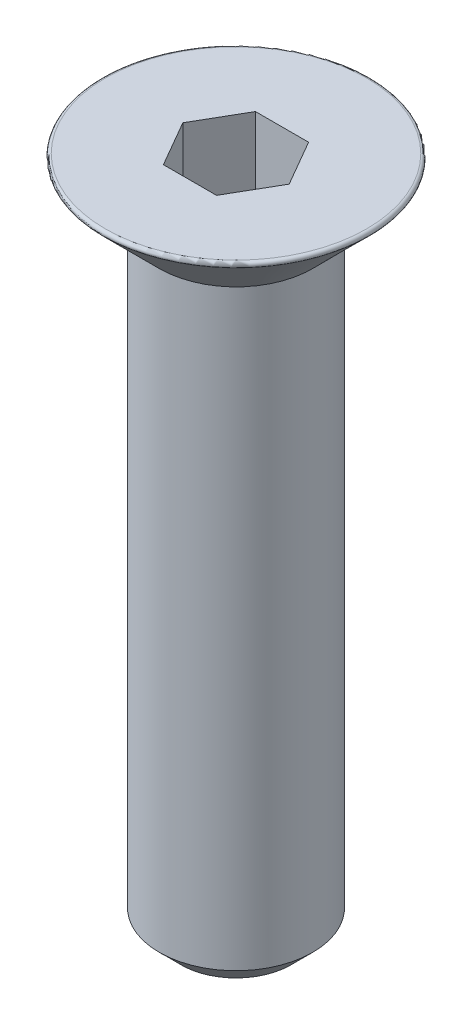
from build123d import *

# Parameters (mm, degrees)
CONG_1_R                = 0.1
CHANFREIN1_SIZE         = 0.7
ENL_V_MAT_EXTRU_1_DEPTH = 3


with BuildPart() as part:
    # Esquisse1 → R_volution1 (revolve)
    with BuildSketch(Plane.XY, mode=Mode.PRIVATE) as r_volution1_sk:
        Polygon((0, 0), (-4.5, 0), (-2.5, -2), (-2.5, -22), (0, -22), align=None)
    revolve(r_volution1_sk.sketch.rotate(Axis((0, 15.487971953, 0), (0, -1, 0)), 270), axis=Axis((0, 15.487971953, 0), (0, -1, 0)))

    # Cong_1
    cong_1_edges = [part.edges().sort_by_distance(p)[0] for p in [
        (0, 0, -4.5),
    ]]
    fillet(cong_1_edges, radius=CONG_1_R)

    # Chanfrein1
    chanfrein1_edges = [part.edges().sort_by_distance(p)[0] for p in [
        (0, -22, -2.5),
    ]]
    chamfer(chanfrein1_edges, length=CHANFREIN1_SIZE)

    # Esquisse2 → Enl_v. mat.-Extru.1 (cut)
    with BuildSketch(Plane(origin=(0, 0, 0), x_dir=(1, 0, 0), z_dir=(0, 1, 0))):
        Polygon((1.732050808, 0), (0.866025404, 1.5), (-0.866025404, 1.5), (-1.732050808, 0), (-0.866025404, -1.5), (0.866025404, -1.5), align=None)
    extrude(amount=-ENL_V_MAT_EXTRU_1_DEPTH, mode=Mode.SUBTRACT)


solid = part.part
